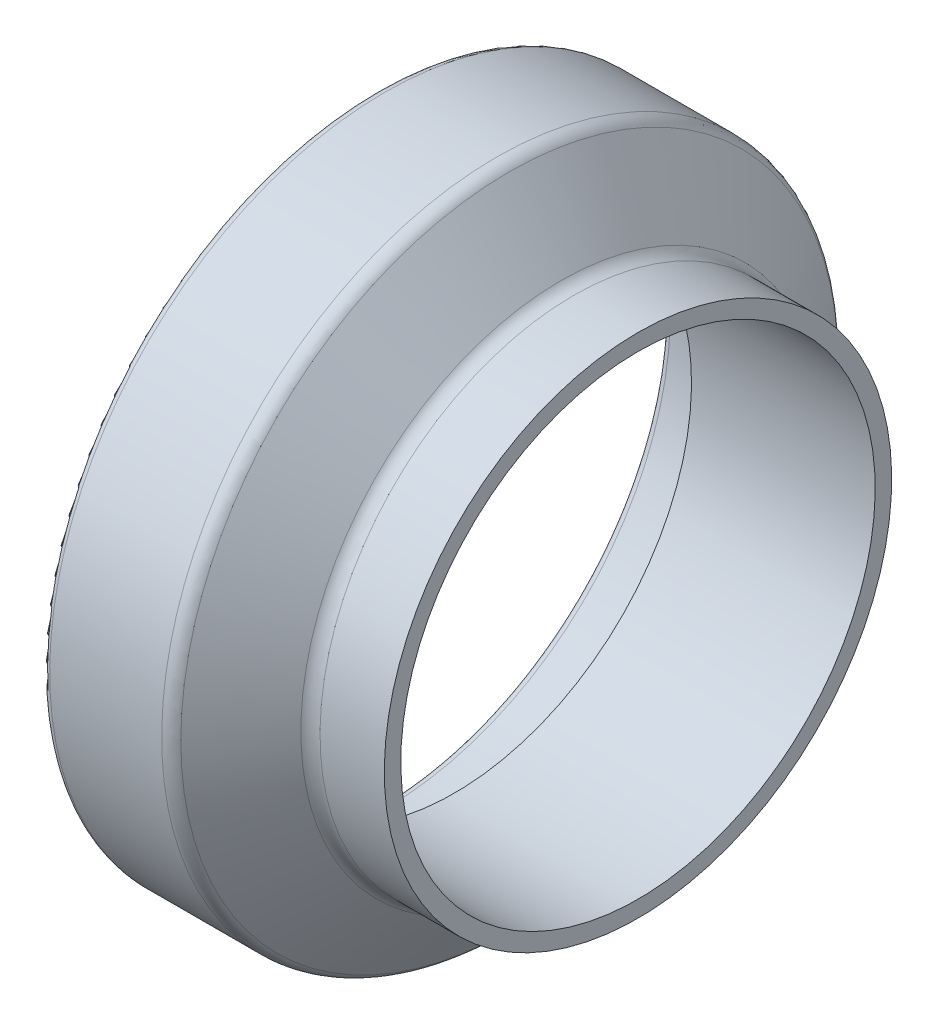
from build123d import *


with BuildPart() as part:
    # Sketch1 → Revolve1 (revolve)
    with BuildSketch(Plane.XY):
        with BuildLine():
            Line((-9.602183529, 23.749), (-27.991783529, 23.749))
            Line((-27.991783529, 23.749), (-27.991783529, 27.8003))
            ThreePointArc((-27.991783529, 27.8003), (-28.229847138, 28.375036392), (-28.804583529, 28.6131))
            Line((-28.804583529, 28.6131), (-34.976783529, 28.6131))
            ThreePointArc((-34.976783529, 28.6131), (-35.551519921, 28.851163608), (-35.789583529, 29.4259))
            Line((-35.789583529, 29.4259), (-35.789583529, 32.7152))
            ThreePointArc((-35.789583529, 32.7152), (-35.551519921, 33.289936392), (-34.976783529, 33.528))
            Line((-34.976783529, 33.528), (-23.760413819, 33.528))
            ThreePointArc((-23.760413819, 33.528), (-23.046408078, 33.359873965), (-22.482437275, 32.8908244))
            Line((-22.482437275, 32.8908244), (-17.317842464, 26.0371756))
            ThreePointArc((-17.317842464, 26.0371756), (-16.753871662, 25.568126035), (-16.039865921, 25.4))
            Line((-16.039865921, 25.4), (-9.602183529, 25.4))
            Line((-9.602183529, 25.4), (-9.602183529, 23.749))
        make_face()
    revolve(axis=Axis((0, 0, 0), (-1, 0, 0)))


solid = part.part
